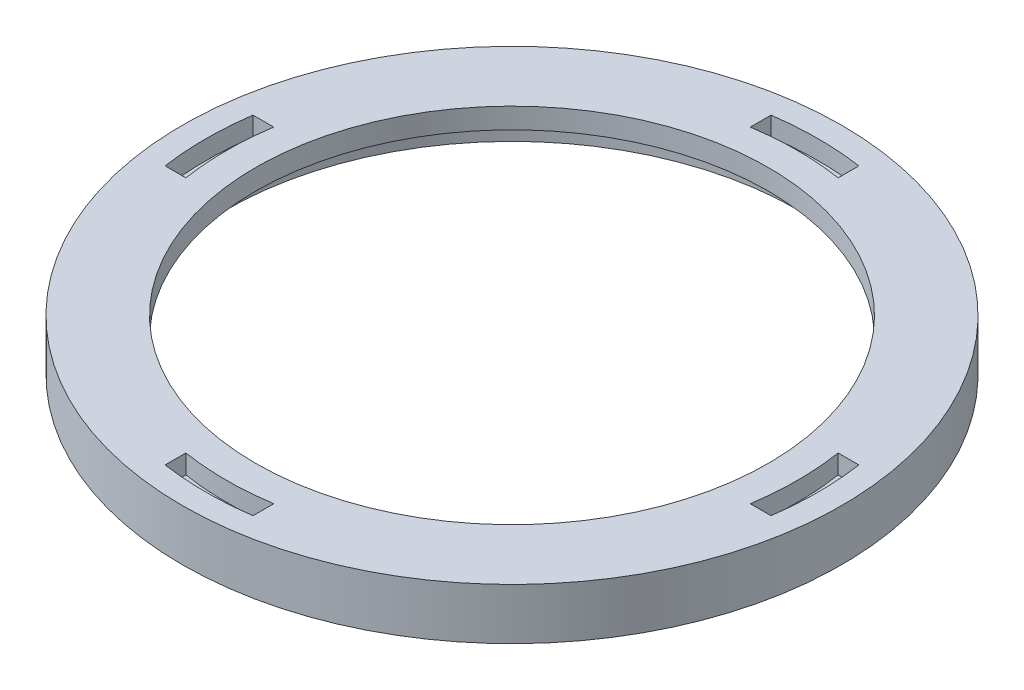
ISO-10303-21;
HEADER;
FILE_DESCRIPTION(('STEP AP214'),'2;1');
FILE_NAME('part.step','',(''),(''),'','','');
FILE_SCHEMA(('AUTOMOTIVE_DESIGN { 1 0 10303 214 1 1 1 1 }'));
ENDSEC;
DATA;
#1=APPLICATION_CONTEXT('core data for automotive mechanical design processes');
#2=APPLICATION_PROTOCOL_DEFINITION('international standard','automotive_design',2000,#1);
#3=PRODUCT_CONTEXT('',#1,'mechanical');
#4=PRODUCT('Part','Part','',(#3));
#5=PRODUCT_RELATED_PRODUCT_CATEGORY('part','',(#4));
#6=PRODUCT_DEFINITION_FORMATION('','',#4);
#7=PRODUCT_DEFINITION_CONTEXT('part definition',#1,'design');
#8=PRODUCT_DEFINITION('design','',#6,#7);
#9=PRODUCT_DEFINITION_SHAPE('','',#8);
#10=(LENGTH_UNIT() NAMED_UNIT(*) SI_UNIT(.MILLI.,.METRE.));
#11=(NAMED_UNIT(*) PLANE_ANGLE_UNIT() SI_UNIT($,.RADIAN.));
#12=(NAMED_UNIT(*) SI_UNIT($,.STERADIAN.) SOLID_ANGLE_UNIT());
#13=UNCERTAINTY_MEASURE_WITH_UNIT(LENGTH_MEASURE(1.E-05),#10,'distance_accuracy_value','');
#14=(GEOMETRIC_REPRESENTATION_CONTEXT(3) GLOBAL_UNCERTAINTY_ASSIGNED_CONTEXT((#13)) GLOBAL_UNIT_ASSIGNED_CONTEXT((#10,
#11,#12)) REPRESENTATION_CONTEXT('',''));
#15=CARTESIAN_POINT('',(0.,0.,0.));
#16=DIRECTION('',(0.,0.,1.));
#17=DIRECTION('',(1.,0.,0.));
#18=AXIS2_PLACEMENT_3D('',#15,#16,#17);
#19=CARTESIAN_POINT('',(0.,-4.445,0.));
#20=DIRECTION('',(0.,1.,0.));
#21=DIRECTION('',(0.,0.,1.));
#22=AXIS2_PLACEMENT_3D('',#19,#20,#21);
#23=CYLINDRICAL_SURFACE('',#22,22.225);
#24=CARTESIAN_POINT('',(0.,0.,0.));
#25=DIRECTION('',(0.,1.,0.));
#26=DIRECTION('',(0.,0.,1.));
#27=AXIS2_PLACEMENT_3D('',#24,#25,#26);
#28=CIRCLE('',#27,22.225);
#29=CARTESIAN_POINT('',(0.,0.,22.225));
#30=VERTEX_POINT('',#29);
#31=EDGE_CURVE('E268',#30,#30,#28,.T.);
#32=ORIENTED_EDGE('',*,*,#31,.T.);
#33=EDGE_LOOP('',(#32));
#34=FACE_BOUND('',#33,.T.);
#35=CARTESIAN_POINT('',(0.,-1.778,0.));
#36=DIRECTION('',(0.,-1.,0.));
#37=DIRECTION('',(0.,0.,-1.));
#38=AXIS2_PLACEMENT_3D('',#35,#36,#37);
#39=CIRCLE('',#38,22.225);
#40=CARTESIAN_POINT('',(0.,-1.778,-22.225));
#41=VERTEX_POINT('',#40);
#42=EDGE_CURVE('E32',#41,#41,#39,.F.);
#43=ORIENTED_EDGE('',*,*,#42,.F.);
#44=EDGE_LOOP('',(#43));
#45=FACE_BOUND('',#44,.T.);
#46=ADVANCED_FACE('F28',(#34,#45),#23,.F.);
#47=CARTESIAN_POINT('',(0.,0.,0.));
#48=DIRECTION('',(0.,1.,0.));
#49=DIRECTION('',(0.,0.,1.));
#50=AXIS2_PLACEMENT_3D('',#47,#48,#49);
#51=PLANE('',#50);
#52=CARTESIAN_POINT('',(0.,0.,0.));
#53=DIRECTION('',(0.,-1.,0.));
#54=DIRECTION('',(0.,0.,-1.));
#55=AXIS2_PLACEMENT_3D('',#52,#53,#54);
#56=CIRCLE('',#55,24.765);
#57=CARTESIAN_POINT('',(3.81000000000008,0.,24.4701680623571));
#58=VERTEX_POINT('',#57);
#59=CARTESIAN_POINT('',(-3.80999999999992,0.,24.4701680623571));
#60=VERTEX_POINT('',#59);
#61=EDGE_CURVE('E44',#58,#60,#56,.T.);
#62=ORIENTED_EDGE('',*,*,#61,.F.);
#63=DIRECTION('',(0.,0.,1.));
#64=VECTOR('',#63,1.);
#65=CARTESIAN_POINT('',(3.81000000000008,0.,24.4701680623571));
#66=LINE('',#65,#64);
#67=CARTESIAN_POINT('',(3.81000000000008,0.,26.2681318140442));
#68=VERTEX_POINT('',#67);
#69=EDGE_CURVE('E166',#58,#68,#66,.T.);
#70=ORIENTED_EDGE('',*,*,#69,.T.);
#71=CARTESIAN_POINT('',(0.,0.,0.));
#72=DIRECTION('',(0.,-1.,0.));
#73=DIRECTION('',(0.,0.,-1.));
#74=AXIS2_PLACEMENT_3D('',#71,#72,#73);
#75=CIRCLE('',#74,26.543);
#76=CARTESIAN_POINT('',(-3.80999999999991,0.,26.2681318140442));
#77=VERTEX_POINT('',#76);
#78=EDGE_CURVE('E148',#68,#77,#75,.T.);
#79=ORIENTED_EDGE('',*,*,#78,.T.);
#80=DIRECTION('',(0.,0.,1.));
#81=VECTOR('',#80,1.);
#82=CARTESIAN_POINT('',(-3.80999999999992,0.,24.4701680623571));
#83=LINE('',#82,#81);
#84=EDGE_CURVE('E159',#60,#77,#83,.T.);
#85=ORIENTED_EDGE('',*,*,#84,.F.);
#86=EDGE_LOOP('',(#62,#70,#79,#85));
#87=FACE_BOUND('',#86,.T.);
#88=CARTESIAN_POINT('',(0.,0.,0.));
#89=DIRECTION('',(0.,1.,0.));
#90=DIRECTION('',(0.,0.,1.));
#91=AXIS2_PLACEMENT_3D('',#88,#89,#90);
#92=CIRCLE('',#91,26.543);
#93=CARTESIAN_POINT('',(-26.2681318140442,0.,-3.81000000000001));
#94=VERTEX_POINT('',#93);
#95=CARTESIAN_POINT('',(-26.2681318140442,0.,3.80999999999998));
#96=VERTEX_POINT('',#95);
#97=EDGE_CURVE('E52',#94,#96,#92,.T.);
#98=ORIENTED_EDGE('',*,*,#97,.F.);
#99=DIRECTION('',(-1.,0.,0.));
#100=VECTOR('',#99,1.);
#101=CARTESIAN_POINT('',(-24.4701680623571,0.,-3.80999999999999));
#102=LINE('',#101,#100);
#103=CARTESIAN_POINT('',(-24.4701680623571,0.,-3.80999999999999));
#104=VERTEX_POINT('',#103);
#105=EDGE_CURVE('E190',#104,#94,#102,.T.);
#106=ORIENTED_EDGE('',*,*,#105,.F.);
#107=CARTESIAN_POINT('',(0.,0.,0.));
#108=DIRECTION('',(0.,1.,0.));
#109=DIRECTION('',(0.,0.,1.));
#110=AXIS2_PLACEMENT_3D('',#107,#108,#109);
#111=CIRCLE('',#110,24.765);
#112=CARTESIAN_POINT('',(-24.4701680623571,0.,3.81));
#113=VERTEX_POINT('',#112);
#114=EDGE_CURVE('E187',#104,#113,#111,.T.);
#115=ORIENTED_EDGE('',*,*,#114,.T.);
#116=DIRECTION('',(-1.,0.,0.));
#117=VECTOR('',#116,1.);
#118=CARTESIAN_POINT('',(-24.4701680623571,0.,3.81000000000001));
#119=LINE('',#118,#117);
#120=EDGE_CURVE('E184',#113,#96,#119,.T.);
#121=ORIENTED_EDGE('',*,*,#120,.T.);
#122=EDGE_LOOP('',(#98,#106,#115,#121));
#123=FACE_BOUND('',#122,.T.);
#124=CARTESIAN_POINT('',(0.,0.,0.));
#125=DIRECTION('',(0.,1.,0.));
#126=DIRECTION('',(0.,0.,1.));
#127=AXIS2_PLACEMENT_3D('',#124,#125,#126);
#128=CIRCLE('',#127,28.575);
#129=CARTESIAN_POINT('',(0.,0.,28.575));
#130=VERTEX_POINT('',#129);
#131=EDGE_CURVE('E37',#130,#130,#128,.T.);
#132=ORIENTED_EDGE('',*,*,#131,.T.);
#133=EDGE_LOOP('',(#132));
#134=FACE_BOUND('',#133,.T.);
#135=ORIENTED_EDGE('',*,*,#31,.F.);
#136=EDGE_LOOP('',(#135));
#137=FACE_BOUND('',#136,.T.);
#138=CARTESIAN_POINT('',(0.,0.,0.));
#139=DIRECTION('',(0.,-1.,0.));
#140=DIRECTION('',(0.,0.,-1.));
#141=AXIS2_PLACEMENT_3D('',#138,#139,#140);
#142=CIRCLE('',#141,24.765);
#143=CARTESIAN_POINT('',(-3.81000000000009,0.,-24.4701680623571));
#144=VERTEX_POINT('',#143);
#145=CARTESIAN_POINT('',(3.80999999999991,0.,-24.4701680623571));
#146=VERTEX_POINT('',#145);
#147=EDGE_CURVE('E244',#144,#146,#142,.T.);
#148=ORIENTED_EDGE('',*,*,#147,.F.);
#149=DIRECTION('',(0.,0.,-1.));
#150=VECTOR('',#149,1.);
#151=CARTESIAN_POINT('',(-3.81000000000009,0.,-24.4701680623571));
#152=LINE('',#151,#150);
#153=CARTESIAN_POINT('',(-3.81000000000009,0.,-26.2681318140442));
#154=VERTEX_POINT('',#153);
#155=EDGE_CURVE('E252',#144,#154,#152,.T.);
#156=ORIENTED_EDGE('',*,*,#155,.T.);
#157=CARTESIAN_POINT('',(0.,0.,0.));
#158=DIRECTION('',(0.,-1.,0.));
#159=DIRECTION('',(0.,0.,-1.));
#160=AXIS2_PLACEMENT_3D('',#157,#158,#159);
#161=CIRCLE('',#160,26.543);
#162=CARTESIAN_POINT('',(3.8099999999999,0.,-26.2681318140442));
#163=VERTEX_POINT('',#162);
#164=EDGE_CURVE('E249',#154,#163,#161,.T.);
#165=ORIENTED_EDGE('',*,*,#164,.T.);
#166=DIRECTION('',(0.,0.,-1.));
#167=VECTOR('',#166,1.);
#168=CARTESIAN_POINT('',(3.80999999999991,0.,-24.4701680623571));
#169=LINE('',#168,#167);
#170=EDGE_CURVE('E246',#146,#163,#169,.T.);
#171=ORIENTED_EDGE('',*,*,#170,.F.);
#172=EDGE_LOOP('',(#148,#156,#165,#171));
#173=FACE_BOUND('',#172,.T.);
#174=DIRECTION('',(1.,0.,0.));
#175=VECTOR('',#174,1.);
#176=CARTESIAN_POINT('',(24.4701680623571,0.,3.81));
#177=LINE('',#176,#175);
#178=CARTESIAN_POINT('',(24.4701680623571,0.,3.81));
#179=VERTEX_POINT('',#178);
#180=CARTESIAN_POINT('',(26.2681318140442,0.,3.81));
#181=VERTEX_POINT('',#180);
#182=EDGE_CURVE('E220',#179,#181,#177,.T.);
#183=ORIENTED_EDGE('',*,*,#182,.F.);
#184=CARTESIAN_POINT('',(0.,0.,0.));
#185=DIRECTION('',(0.,1.,0.));
#186=DIRECTION('',(0.,0.,1.));
#187=AXIS2_PLACEMENT_3D('',#184,#185,#186);
#188=CIRCLE('',#187,24.765);
#189=CARTESIAN_POINT('',(24.4701680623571,0.,-3.81));
#190=VERTEX_POINT('',#189);
#191=EDGE_CURVE('E206',#179,#190,#188,.T.);
#192=ORIENTED_EDGE('',*,*,#191,.T.);
#193=DIRECTION('',(1.,0.,0.));
#194=VECTOR('',#193,1.);
#195=CARTESIAN_POINT('',(24.4701680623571,0.,-3.81));
#196=LINE('',#195,#194);
#197=CARTESIAN_POINT('',(26.2681318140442,0.,-3.81));
#198=VERTEX_POINT('',#197);
#199=EDGE_CURVE('E214',#190,#198,#196,.T.);
#200=ORIENTED_EDGE('',*,*,#199,.T.);
#201=CARTESIAN_POINT('',(0.,0.,0.));
#202=DIRECTION('',(0.,1.,0.));
#203=DIRECTION('',(0.,0.,1.));
#204=AXIS2_PLACEMENT_3D('',#201,#202,#203);
#205=CIRCLE('',#204,26.543);
#206=EDGE_CURVE('E217',#181,#198,#205,.T.);
#207=ORIENTED_EDGE('',*,*,#206,.F.);
#208=EDGE_LOOP('',(#183,#192,#200,#207));
#209=FACE_BOUND('',#208,.T.);
#210=ADVANCED_FACE('F163',(#87,#123,#134,#137,#173,#209),#51,.T.);
#211=CARTESIAN_POINT('',(0.,-4.445,0.));
#212=DIRECTION('',(0.,1.,0.));
#213=DIRECTION('',(0.,0.,1.));
#214=AXIS2_PLACEMENT_3D('',#211,#212,#213);
#215=CYLINDRICAL_SURFACE('',#214,28.575);
#216=CARTESIAN_POINT('',(0.,-4.445,0.));
#217=DIRECTION('',(0.,1.,0.));
#218=DIRECTION('',(0.,0.,1.));
#219=AXIS2_PLACEMENT_3D('',#216,#217,#218);
#220=CIRCLE('',#219,28.575);
#221=CARTESIAN_POINT('',(0.,-4.445,28.575));
#222=VERTEX_POINT('',#221);
#223=EDGE_CURVE('E11',#222,#222,#220,.T.);
#224=ORIENTED_EDGE('',*,*,#223,.T.);
#225=EDGE_LOOP('',(#224));
#226=FACE_BOUND('',#225,.T.);
#227=ORIENTED_EDGE('',*,*,#131,.F.);
#228=EDGE_LOOP('',(#227));
#229=FACE_BOUND('',#228,.T.);
#230=ADVANCED_FACE('F30',(#226,#229),#215,.T.);
#231=CARTESIAN_POINT('',(0.,-4.445,0.));
#232=DIRECTION('',(0.,1.,0.));
#233=DIRECTION('',(0.,0.,1.));
#234=AXIS2_PLACEMENT_3D('',#231,#232,#233);
#235=PLANE('',#234);
#236=CARTESIAN_POINT('',(0.,-4.445,0.));
#237=DIRECTION('',(0.,-1.,0.));
#238=DIRECTION('',(0.,0.,-1.));
#239=AXIS2_PLACEMENT_3D('',#236,#237,#238);
#240=CIRCLE('',#239,24.765);
#241=CARTESIAN_POINT('',(0.,-4.445,-24.765));
#242=VERTEX_POINT('',#241);
#243=EDGE_CURVE('E387',#242,#242,#240,.T.);
#244=ORIENTED_EDGE('',*,*,#243,.F.);
#245=EDGE_LOOP('',(#244));
#246=FACE_BOUND('',#245,.T.);
#247=ORIENTED_EDGE('',*,*,#223,.F.);
#248=EDGE_LOOP('',(#247));
#249=FACE_BOUND('',#248,.T.);
#250=ADVANCED_FACE('F283',(#246,#249),#235,.F.);
#251=CARTESIAN_POINT('',(0.,-1.651,0.));
#252=DIRECTION('',(0.,1.,0.));
#253=DIRECTION('',(0.,0.,1.));
#254=AXIS2_PLACEMENT_3D('',#251,#252,#253);
#255=CYLINDRICAL_SURFACE('',#254,24.765);
#256=ORIENTED_EDGE('',*,*,#147,.T.);
#257=DIRECTION('',(0.,1.,0.));
#258=VECTOR('',#257,1.);
#259=CARTESIAN_POINT('',(3.80999999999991,-1.651,-24.4701680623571));
#260=LINE('',#259,#258);
#261=CARTESIAN_POINT('',(3.80999999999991,-1.651,-24.4701680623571));
#262=VERTEX_POINT('',#261);
#263=EDGE_CURVE('E265',#262,#146,#260,.T.);
#264=ORIENTED_EDGE('',*,*,#263,.F.);
#265=CARTESIAN_POINT('',(0.,-1.651,0.));
#266=DIRECTION('',(0.,-1.,0.));
#267=DIRECTION('',(0.,0.,-1.));
#268=AXIS2_PLACEMENT_3D('',#265,#266,#267);
#269=CIRCLE('',#268,24.765);
#270=CARTESIAN_POINT('',(-3.81000000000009,-1.651,-24.4701680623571));
#271=VERTEX_POINT('',#270);
#272=EDGE_CURVE('E255',#271,#262,#269,.T.);
#273=ORIENTED_EDGE('',*,*,#272,.F.);
#274=DIRECTION('',(0.,1.,0.));
#275=VECTOR('',#274,1.);
#276=CARTESIAN_POINT('',(-3.81000000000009,-1.651,-24.4701680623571));
#277=LINE('',#276,#275);
#278=EDGE_CURVE('E266',#271,#144,#277,.T.);
#279=ORIENTED_EDGE('',*,*,#278,.T.);
#280=EDGE_LOOP('',(#256,#264,#273,#279));
#281=FACE_BOUND('',#280,.T.);
#282=ADVANCED_FACE('F289',(#281),#255,.T.);
#283=CARTESIAN_POINT('',(-3.81000000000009,-1.651,-24.4701680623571));
#284=DIRECTION('',(1.,0.,0.));
#285=DIRECTION('',(0.,0.,-1.));
#286=AXIS2_PLACEMENT_3D('',#283,#284,#285);
#287=PLANE('',#286);
#288=ORIENTED_EDGE('',*,*,#155,.F.);
#289=ORIENTED_EDGE('',*,*,#278,.F.);
#290=DIRECTION('',(0.,0.,-1.));
#291=VECTOR('',#290,1.);
#292=CARTESIAN_POINT('',(-3.81000000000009,-1.651,-24.4701680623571));
#293=LINE('',#292,#291);
#294=CARTESIAN_POINT('',(-3.81000000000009,-1.651,-26.2681318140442));
#295=VERTEX_POINT('',#294);
#296=EDGE_CURVE('E263',#271,#295,#293,.T.);
#297=ORIENTED_EDGE('',*,*,#296,.T.);
#298=DIRECTION('',(0.,1.,0.));
#299=VECTOR('',#298,1.);
#300=CARTESIAN_POINT('',(-3.81000000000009,-1.651,-26.2681318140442));
#301=LINE('',#300,#299);
#302=EDGE_CURVE('E269',#295,#154,#301,.T.);
#303=ORIENTED_EDGE('',*,*,#302,.T.);
#304=EDGE_LOOP('',(#288,#289,#297,#303));
#305=FACE_BOUND('',#304,.T.);
#306=ADVANCED_FACE('F302',(#305),#287,.T.);
#307=CARTESIAN_POINT('',(0.,-1.651,0.));
#308=DIRECTION('',(0.,1.,0.));
#309=DIRECTION('',(0.,0.,1.));
#310=AXIS2_PLACEMENT_3D('',#307,#308,#309);
#311=CYLINDRICAL_SURFACE('',#310,26.543);
#312=ORIENTED_EDGE('',*,*,#164,.F.);
#313=ORIENTED_EDGE('',*,*,#302,.F.);
#314=CARTESIAN_POINT('',(0.,-1.651,0.));
#315=DIRECTION('',(0.,-1.,0.));
#316=DIRECTION('',(0.,0.,-1.));
#317=AXIS2_PLACEMENT_3D('',#314,#315,#316);
#318=CIRCLE('',#317,26.543);
#319=CARTESIAN_POINT('',(3.8099999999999,-1.651,-26.2681318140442));
#320=VERTEX_POINT('',#319);
#321=EDGE_CURVE('E261',#295,#320,#318,.T.);
#322=ORIENTED_EDGE('',*,*,#321,.T.);
#323=DIRECTION('',(0.,1.,0.));
#324=VECTOR('',#323,1.);
#325=CARTESIAN_POINT('',(3.8099999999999,-1.651,-26.2681318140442));
#326=LINE('',#325,#324);
#327=EDGE_CURVE('E271',#320,#163,#326,.T.);
#328=ORIENTED_EDGE('',*,*,#327,.T.);
#329=EDGE_LOOP('',(#312,#313,#322,#328));
#330=FACE_BOUND('',#329,.T.);
#331=ADVANCED_FACE('F308',(#330),#311,.F.);
#332=CARTESIAN_POINT('',(3.80999999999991,-1.651,-24.4701680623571));
#333=DIRECTION('',(1.,0.,0.));
#334=DIRECTION('',(0.,0.,-1.));
#335=AXIS2_PLACEMENT_3D('',#332,#333,#334);
#336=PLANE('',#335);
#337=ORIENTED_EDGE('',*,*,#170,.T.);
#338=ORIENTED_EDGE('',*,*,#327,.F.);
#339=DIRECTION('',(0.,0.,-1.));
#340=VECTOR('',#339,1.);
#341=CARTESIAN_POINT('',(3.80999999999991,-1.651,-24.4701680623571));
#342=LINE('',#341,#340);
#343=EDGE_CURVE('E258',#262,#320,#342,.T.);
#344=ORIENTED_EDGE('',*,*,#343,.F.);
#345=ORIENTED_EDGE('',*,*,#263,.T.);
#346=EDGE_LOOP('',(#337,#338,#344,#345));
#347=FACE_BOUND('',#346,.T.);
#348=ADVANCED_FACE('F304',(#347),#336,.F.);
#349=CARTESIAN_POINT('',(0.,-1.651,0.));
#350=DIRECTION('',(0.,-1.,0.));
#351=DIRECTION('',(0.,0.,-1.));
#352=AXIS2_PLACEMENT_3D('',#349,#350,#351);
#353=PLANE('',#352);
#354=ORIENTED_EDGE('',*,*,#272,.T.);
#355=ORIENTED_EDGE('',*,*,#343,.T.);
#356=ORIENTED_EDGE('',*,*,#321,.F.);
#357=ORIENTED_EDGE('',*,*,#296,.F.);
#358=EDGE_LOOP('',(#354,#355,#356,#357));
#359=FACE_BOUND('',#358,.T.);
#360=ADVANCED_FACE('F307',(#359),#353,.F.);
#361=CARTESIAN_POINT('',(0.,-1.651,0.));
#362=DIRECTION('',(0.,1.,0.));
#363=DIRECTION('',(0.,0.,1.));
#364=AXIS2_PLACEMENT_3D('',#361,#362,#363);
#365=CYLINDRICAL_SURFACE('',#364,24.765);
#366=ORIENTED_EDGE('',*,*,#191,.F.);
#367=DIRECTION('',(0.,1.,0.));
#368=VECTOR('',#367,1.);
#369=CARTESIAN_POINT('',(24.4701680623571,-1.651,3.81));
#370=LINE('',#369,#368);
#371=CARTESIAN_POINT('',(24.4701680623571,-1.651,3.81));
#372=VERTEX_POINT('',#371);
#373=EDGE_CURVE('E234',#372,#179,#370,.T.);
#374=ORIENTED_EDGE('',*,*,#373,.F.);
#375=CARTESIAN_POINT('',(0.,-1.651,0.));
#376=DIRECTION('',(0.,1.,0.));
#377=DIRECTION('',(0.,0.,1.));
#378=AXIS2_PLACEMENT_3D('',#375,#376,#377);
#379=CIRCLE('',#378,24.765);
#380=CARTESIAN_POINT('',(24.4701680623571,-1.651,-3.81));
#381=VERTEX_POINT('',#380);
#382=EDGE_CURVE('E223',#372,#381,#379,.T.);
#383=ORIENTED_EDGE('',*,*,#382,.T.);
#384=DIRECTION('',(0.,1.,0.));
#385=VECTOR('',#384,1.);
#386=CARTESIAN_POINT('',(24.4701680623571,-1.651,-3.81));
#387=LINE('',#386,#385);
#388=EDGE_CURVE('E241',#381,#190,#387,.T.);
#389=ORIENTED_EDGE('',*,*,#388,.T.);
#390=EDGE_LOOP('',(#366,#374,#383,#389));
#391=FACE_BOUND('',#390,.T.);
#392=ADVANCED_FACE('F318',(#391),#365,.T.);
#393=CARTESIAN_POINT('',(24.4701680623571,-1.651,-3.81));
#394=DIRECTION('',(0.,0.,1.));
#395=DIRECTION('',(1.,0.,0.));
#396=AXIS2_PLACEMENT_3D('',#393,#394,#395);
#397=PLANE('',#396);
#398=ORIENTED_EDGE('',*,*,#199,.F.);
#399=ORIENTED_EDGE('',*,*,#388,.F.);
#400=DIRECTION('',(1.,0.,0.));
#401=VECTOR('',#400,1.);
#402=CARTESIAN_POINT('',(24.4701680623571,-1.651,-3.81));
#403=LINE('',#402,#401);
#404=CARTESIAN_POINT('',(26.2681318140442,-1.651,-3.81));
#405=VERTEX_POINT('',#404);
#406=EDGE_CURVE('E226',#381,#405,#403,.T.);
#407=ORIENTED_EDGE('',*,*,#406,.T.);
#408=DIRECTION('',(0.,1.,0.));
#409=VECTOR('',#408,1.);
#410=CARTESIAN_POINT('',(26.2681318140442,-1.651,-3.81));
#411=LINE('',#410,#409);
#412=EDGE_CURVE('E239',#405,#198,#411,.T.);
#413=ORIENTED_EDGE('',*,*,#412,.T.);
#414=EDGE_LOOP('',(#398,#399,#407,#413));
#415=FACE_BOUND('',#414,.T.);
#416=ADVANCED_FACE('F322',(#415),#397,.T.);
#417=CARTESIAN_POINT('',(0.,-1.651,0.));
#418=DIRECTION('',(0.,1.,0.));
#419=DIRECTION('',(0.,0.,1.));
#420=AXIS2_PLACEMENT_3D('',#417,#418,#419);
#421=CYLINDRICAL_SURFACE('',#420,26.543);
#422=ORIENTED_EDGE('',*,*,#206,.T.);
#423=ORIENTED_EDGE('',*,*,#412,.F.);
#424=CARTESIAN_POINT('',(0.,-1.651,0.));
#425=DIRECTION('',(0.,1.,0.));
#426=DIRECTION('',(0.,0.,1.));
#427=AXIS2_PLACEMENT_3D('',#424,#425,#426);
#428=CIRCLE('',#427,26.543);
#429=CARTESIAN_POINT('',(26.2681318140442,-1.651,3.81));
#430=VERTEX_POINT('',#429);
#431=EDGE_CURVE('E228',#430,#405,#428,.T.);
#432=ORIENTED_EDGE('',*,*,#431,.F.);
#433=DIRECTION('',(0.,1.,0.));
#434=VECTOR('',#433,1.);
#435=CARTESIAN_POINT('',(26.2681318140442,-1.651,3.81));
#436=LINE('',#435,#434);
#437=EDGE_CURVE('E237',#430,#181,#436,.T.);
#438=ORIENTED_EDGE('',*,*,#437,.T.);
#439=EDGE_LOOP('',(#422,#423,#432,#438));
#440=FACE_BOUND('',#439,.T.);
#441=ADVANCED_FACE('F326',(#440),#421,.F.);
#442=CARTESIAN_POINT('',(24.4701680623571,-1.651,3.81));
#443=DIRECTION('',(0.,0.,1.));
#444=DIRECTION('',(1.,0.,0.));
#445=AXIS2_PLACEMENT_3D('',#442,#443,#444);
#446=PLANE('',#445);
#447=ORIENTED_EDGE('',*,*,#182,.T.);
#448=ORIENTED_EDGE('',*,*,#437,.F.);
#449=DIRECTION('',(1.,0.,0.));
#450=VECTOR('',#449,1.);
#451=CARTESIAN_POINT('',(24.4701680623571,-1.651,3.81));
#452=LINE('',#451,#450);
#453=EDGE_CURVE('E231',#372,#430,#452,.T.);
#454=ORIENTED_EDGE('',*,*,#453,.F.);
#455=ORIENTED_EDGE('',*,*,#373,.T.);
#456=EDGE_LOOP('',(#447,#448,#454,#455));
#457=FACE_BOUND('',#456,.T.);
#458=ADVANCED_FACE('F330',(#457),#446,.F.);
#459=CARTESIAN_POINT('',(0.,-1.651,0.));
#460=DIRECTION('',(0.,1.,0.));
#461=DIRECTION('',(0.,0.,1.));
#462=AXIS2_PLACEMENT_3D('',#459,#460,#461);
#463=PLANE('',#462);
#464=ORIENTED_EDGE('',*,*,#382,.F.);
#465=ORIENTED_EDGE('',*,*,#453,.T.);
#466=ORIENTED_EDGE('',*,*,#431,.T.);
#467=ORIENTED_EDGE('',*,*,#406,.F.);
#468=EDGE_LOOP('',(#464,#465,#466,#467));
#469=FACE_BOUND('',#468,.T.);
#470=ADVANCED_FACE('F334',(#469),#463,.T.);
#471=CARTESIAN_POINT('',(0.,-1.651,0.));
#472=DIRECTION('',(0.,1.,0.));
#473=DIRECTION('',(0.,0.,1.));
#474=AXIS2_PLACEMENT_3D('',#471,#472,#473);
#475=CYLINDRICAL_SURFACE('',#474,26.543);
#476=ORIENTED_EDGE('',*,*,#97,.T.);
#477=DIRECTION('',(0.,1.,0.));
#478=VECTOR('',#477,1.);
#479=CARTESIAN_POINT('',(-26.2681318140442,-1.651,3.80999999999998));
#480=LINE('',#479,#478);
#481=CARTESIAN_POINT('',(-26.2681318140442,-1.651,3.80999999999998));
#482=VERTEX_POINT('',#481);
#483=EDGE_CURVE('E203',#482,#96,#480,.T.);
#484=ORIENTED_EDGE('',*,*,#483,.F.);
#485=CARTESIAN_POINT('',(0.,-1.651,0.));
#486=DIRECTION('',(0.,1.,0.));
#487=DIRECTION('',(0.,0.,1.));
#488=AXIS2_PLACEMENT_3D('',#485,#486,#487);
#489=CIRCLE('',#488,26.543);
#490=CARTESIAN_POINT('',(-26.2681318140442,-1.651,-3.81000000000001));
#491=VERTEX_POINT('',#490);
#492=EDGE_CURVE('E193',#491,#482,#489,.T.);
#493=ORIENTED_EDGE('',*,*,#492,.F.);
#494=DIRECTION('',(0.,1.,0.));
#495=VECTOR('',#494,1.);
#496=CARTESIAN_POINT('',(-26.2681318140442,-1.651,-3.81000000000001));
#497=LINE('',#496,#495);
#498=EDGE_CURVE('E204',#491,#94,#497,.T.);
#499=ORIENTED_EDGE('',*,*,#498,.T.);
#500=EDGE_LOOP('',(#476,#484,#493,#499));
#501=FACE_BOUND('',#500,.T.);
#502=ADVANCED_FACE('F338',(#501),#475,.F.);
#503=CARTESIAN_POINT('',(-24.4701680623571,-1.651,-3.80999999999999));
#504=DIRECTION('',(0.,0.,-1.));
#505=DIRECTION('',(-1.,0.,0.));
#506=AXIS2_PLACEMENT_3D('',#503,#504,#505);
#507=PLANE('',#506);
#508=ORIENTED_EDGE('',*,*,#105,.T.);
#509=ORIENTED_EDGE('',*,*,#498,.F.);
#510=DIRECTION('',(-1.,0.,0.));
#511=VECTOR('',#510,1.);
#512=CARTESIAN_POINT('',(-24.4701680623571,-1.651,-3.80999999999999));
#513=LINE('',#512,#511);
#514=CARTESIAN_POINT('',(-24.4701680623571,-1.651,-3.80999999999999));
#515=VERTEX_POINT('',#514);
#516=EDGE_CURVE('E200',#515,#491,#513,.T.);
#517=ORIENTED_EDGE('',*,*,#516,.F.);
#518=DIRECTION('',(0.,1.,0.));
#519=VECTOR('',#518,1.);
#520=CARTESIAN_POINT('',(-24.4701680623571,-1.651,-3.80999999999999));
#521=LINE('',#520,#519);
#522=EDGE_CURVE('E207',#515,#104,#521,.T.);
#523=ORIENTED_EDGE('',*,*,#522,.T.);
#524=EDGE_LOOP('',(#508,#509,#517,#523));
#525=FACE_BOUND('',#524,.T.);
#526=ADVANCED_FACE('F342',(#525),#507,.F.);
#527=CARTESIAN_POINT('',(0.,-1.651,0.));
#528=DIRECTION('',(0.,1.,0.));
#529=DIRECTION('',(0.,0.,1.));
#530=AXIS2_PLACEMENT_3D('',#527,#528,#529);
#531=CYLINDRICAL_SURFACE('',#530,24.765);
#532=ORIENTED_EDGE('',*,*,#114,.F.);
#533=ORIENTED_EDGE('',*,*,#522,.F.);
#534=CARTESIAN_POINT('',(0.,-1.651,0.));
#535=DIRECTION('',(0.,1.,0.));
#536=DIRECTION('',(0.,0.,1.));
#537=AXIS2_PLACEMENT_3D('',#534,#535,#536);
#538=CIRCLE('',#537,24.765);
#539=CARTESIAN_POINT('',(-24.4701680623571,-1.651,3.81));
#540=VERTEX_POINT('',#539);
#541=EDGE_CURVE('E198',#515,#540,#538,.T.);
#542=ORIENTED_EDGE('',*,*,#541,.T.);
#543=DIRECTION('',(0.,1.,0.));
#544=VECTOR('',#543,1.);
#545=CARTESIAN_POINT('',(-24.4701680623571,-1.651,3.81));
#546=LINE('',#545,#544);
#547=EDGE_CURVE('E209',#540,#113,#546,.T.);
#548=ORIENTED_EDGE('',*,*,#547,.T.);
#549=EDGE_LOOP('',(#532,#533,#542,#548));
#550=FACE_BOUND('',#549,.T.);
#551=ADVANCED_FACE('F347',(#550),#531,.T.);
#552=CARTESIAN_POINT('',(-24.4701680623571,-1.651,3.81000000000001));
#553=DIRECTION('',(0.,0.,-1.));
#554=DIRECTION('',(-1.,0.,0.));
#555=AXIS2_PLACEMENT_3D('',#552,#553,#554);
#556=PLANE('',#555);
#557=ORIENTED_EDGE('',*,*,#120,.F.);
#558=ORIENTED_EDGE('',*,*,#547,.F.);
#559=DIRECTION('',(-1.,0.,0.));
#560=VECTOR('',#559,1.);
#561=CARTESIAN_POINT('',(-24.4701680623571,-1.651,3.81000000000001));
#562=LINE('',#561,#560);
#563=EDGE_CURVE('E196',#540,#482,#562,.T.);
#564=ORIENTED_EDGE('',*,*,#563,.T.);
#565=ORIENTED_EDGE('',*,*,#483,.T.);
#566=EDGE_LOOP('',(#557,#558,#564,#565));
#567=FACE_BOUND('',#566,.T.);
#568=ADVANCED_FACE('F343',(#567),#556,.T.);
#569=CARTESIAN_POINT('',(0.,-1.651,0.));
#570=DIRECTION('',(0.,1.,0.));
#571=DIRECTION('',(0.,0.,1.));
#572=AXIS2_PLACEMENT_3D('',#569,#570,#571);
#573=PLANE('',#572);
#574=ORIENTED_EDGE('',*,*,#492,.T.);
#575=ORIENTED_EDGE('',*,*,#563,.F.);
#576=ORIENTED_EDGE('',*,*,#541,.F.);
#577=ORIENTED_EDGE('',*,*,#516,.T.);
#578=EDGE_LOOP('',(#574,#575,#576,#577));
#579=FACE_BOUND('',#578,.T.);
#580=ADVANCED_FACE('F346',(#579),#573,.T.);
#581=CARTESIAN_POINT('',(0.,-1.651,0.));
#582=DIRECTION('',(0.,1.,0.));
#583=DIRECTION('',(0.,0.,1.));
#584=AXIS2_PLACEMENT_3D('',#581,#582,#583);
#585=CYLINDRICAL_SURFACE('',#584,24.765);
#586=ORIENTED_EDGE('',*,*,#61,.T.);
#587=DIRECTION('',(0.,1.,0.));
#588=VECTOR('',#587,1.);
#589=CARTESIAN_POINT('',(-3.80999999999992,-1.651,24.4701680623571));
#590=LINE('',#589,#588);
#591=CARTESIAN_POINT('',(-3.80999999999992,-1.651,24.4701680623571));
#592=VERTEX_POINT('',#591);
#593=EDGE_CURVE('E156',#592,#60,#590,.T.);
#594=ORIENTED_EDGE('',*,*,#593,.F.);
#595=CARTESIAN_POINT('',(0.,-1.651,0.));
#596=DIRECTION('',(0.,-1.,0.));
#597=DIRECTION('',(0.,0.,-1.));
#598=AXIS2_PLACEMENT_3D('',#595,#596,#597);
#599=CIRCLE('',#598,24.765);
#600=CARTESIAN_POINT('',(3.81000000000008,-1.651,24.4701680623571));
#601=VERTEX_POINT('',#600);
#602=EDGE_CURVE('E168',#601,#592,#599,.T.);
#603=ORIENTED_EDGE('',*,*,#602,.F.);
#604=DIRECTION('',(0.,1.,0.));
#605=VECTOR('',#604,1.);
#606=CARTESIAN_POINT('',(3.81000000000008,-1.651,24.4701680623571));
#607=LINE('',#606,#605);
#608=EDGE_CURVE('E179',#601,#58,#607,.T.);
#609=ORIENTED_EDGE('',*,*,#608,.T.);
#610=EDGE_LOOP('',(#586,#594,#603,#609));
#611=FACE_BOUND('',#610,.T.);
#612=ADVANCED_FACE('F357',(#611),#585,.T.);
#613=CARTESIAN_POINT('',(3.81000000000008,-1.651,24.4701680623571));
#614=DIRECTION('',(-1.,0.,0.));
#615=DIRECTION('',(0.,0.,1.));
#616=AXIS2_PLACEMENT_3D('',#613,#614,#615);
#617=PLANE('',#616);
#618=ORIENTED_EDGE('',*,*,#69,.F.);
#619=ORIENTED_EDGE('',*,*,#608,.F.);
#620=DIRECTION('',(0.,0.,1.));
#621=VECTOR('',#620,1.);
#622=CARTESIAN_POINT('',(3.81000000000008,-1.651,24.4701680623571));
#623=LINE('',#622,#621);
#624=CARTESIAN_POINT('',(3.81000000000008,-1.651,26.2681318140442));
#625=VERTEX_POINT('',#624);
#626=EDGE_CURVE('E177',#601,#625,#623,.T.);
#627=ORIENTED_EDGE('',*,*,#626,.T.);
#628=DIRECTION('',(0.,1.,0.));
#629=VECTOR('',#628,1.);
#630=CARTESIAN_POINT('',(3.81000000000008,-1.651,26.2681318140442));
#631=LINE('',#630,#629);
#632=EDGE_CURVE('E155',#625,#68,#631,.T.);
#633=ORIENTED_EDGE('',*,*,#632,.T.);
#634=EDGE_LOOP('',(#618,#619,#627,#633));
#635=FACE_BOUND('',#634,.T.);
#636=ADVANCED_FACE('F361',(#635),#617,.T.);
#637=CARTESIAN_POINT('',(0.,-1.651,0.));
#638=DIRECTION('',(0.,1.,0.));
#639=DIRECTION('',(0.,0.,1.));
#640=AXIS2_PLACEMENT_3D('',#637,#638,#639);
#641=CYLINDRICAL_SURFACE('',#640,26.543);
#642=ORIENTED_EDGE('',*,*,#78,.F.);
#643=ORIENTED_EDGE('',*,*,#632,.F.);
#644=CARTESIAN_POINT('',(0.,-1.651,0.));
#645=DIRECTION('',(0.,-1.,0.));
#646=DIRECTION('',(0.,0.,-1.));
#647=AXIS2_PLACEMENT_3D('',#644,#645,#646);
#648=CIRCLE('',#647,26.543);
#649=CARTESIAN_POINT('',(-3.80999999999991,-1.651,26.2681318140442));
#650=VERTEX_POINT('',#649);
#651=EDGE_CURVE('E151',#625,#650,#648,.T.);
#652=ORIENTED_EDGE('',*,*,#651,.T.);
#653=DIRECTION('',(0.,1.,0.));
#654=VECTOR('',#653,1.);
#655=CARTESIAN_POINT('',(-3.80999999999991,-1.651,26.2681318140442));
#656=LINE('',#655,#654);
#657=EDGE_CURVE('E143',#650,#77,#656,.T.);
#658=ORIENTED_EDGE('',*,*,#657,.T.);
#659=EDGE_LOOP('',(#642,#643,#652,#658));
#660=FACE_BOUND('',#659,.T.);
#661=ADVANCED_FACE('F145',(#660),#641,.F.);
#662=CARTESIAN_POINT('',(-3.80999999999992,-1.651,24.4701680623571));
#663=DIRECTION('',(-1.,0.,0.));
#664=DIRECTION('',(0.,0.,1.));
#665=AXIS2_PLACEMENT_3D('',#662,#663,#664);
#666=PLANE('',#665);
#667=ORIENTED_EDGE('',*,*,#84,.T.);
#668=ORIENTED_EDGE('',*,*,#657,.F.);
#669=DIRECTION('',(0.,0.,1.));
#670=VECTOR('',#669,1.);
#671=CARTESIAN_POINT('',(-3.80999999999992,-1.651,24.4701680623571));
#672=LINE('',#671,#670);
#673=EDGE_CURVE('E174',#592,#650,#672,.T.);
#674=ORIENTED_EDGE('',*,*,#673,.F.);
#675=ORIENTED_EDGE('',*,*,#593,.T.);
#676=EDGE_LOOP('',(#667,#668,#674,#675));
#677=FACE_BOUND('',#676,.T.);
#678=ADVANCED_FACE('F160',(#677),#666,.F.);
#679=CARTESIAN_POINT('',(0.,-1.651,0.));
#680=DIRECTION('',(0.,-1.,0.));
#681=DIRECTION('',(0.,0.,-1.));
#682=AXIS2_PLACEMENT_3D('',#679,#680,#681);
#683=PLANE('',#682);
#684=ORIENTED_EDGE('',*,*,#602,.T.);
#685=ORIENTED_EDGE('',*,*,#673,.T.);
#686=ORIENTED_EDGE('',*,*,#651,.F.);
#687=ORIENTED_EDGE('',*,*,#626,.F.);
#688=EDGE_LOOP('',(#684,#685,#686,#687));
#689=FACE_BOUND('',#688,.T.);
#690=ADVANCED_FACE('F364',(#689),#683,.F.);
#691=CARTESIAN_POINT('',(0.,-1.778,0.));
#692=DIRECTION('',(0.,-1.,0.));
#693=DIRECTION('',(0.,0.,-1.));
#694=AXIS2_PLACEMENT_3D('',#691,#692,#693);
#695=PLANE('',#694);
#696=CARTESIAN_POINT('',(0.,-1.778,0.));
#697=DIRECTION('',(0.,-1.,0.));
#698=DIRECTION('',(0.,0.,-1.));
#699=AXIS2_PLACEMENT_3D('',#696,#697,#698);
#700=CIRCLE('',#699,24.765);
#701=CARTESIAN_POINT('',(0.,-1.778,-24.765));
#702=VERTEX_POINT('',#701);
#703=EDGE_CURVE('E384',#702,#702,#700,.T.);
#704=ORIENTED_EDGE('',*,*,#703,.T.);
#705=EDGE_LOOP('',(#704));
#706=FACE_BOUND('',#705,.T.);
#707=ORIENTED_EDGE('',*,*,#42,.T.);
#708=EDGE_LOOP('',(#707));
#709=FACE_BOUND('',#708,.T.);
#710=ADVANCED_FACE('F371',(#706,#709),#695,.T.);
#711=CARTESIAN_POINT('',(0.,-1.778,0.));
#712=DIRECTION('',(0.,-1.,0.));
#713=DIRECTION('',(0.,0.,-1.));
#714=AXIS2_PLACEMENT_3D('',#711,#712,#713);
#715=CYLINDRICAL_SURFACE('',#714,24.765);
#716=ORIENTED_EDGE('',*,*,#703,.F.);
#717=EDGE_LOOP('',(#716));
#718=FACE_BOUND('',#717,.T.);
#719=ORIENTED_EDGE('',*,*,#243,.T.);
#720=EDGE_LOOP('',(#719));
#721=FACE_BOUND('',#720,.T.);
#722=ADVANCED_FACE('F373',(#718,#721),#715,.F.);
#723=CLOSED_SHELL('',(#46,#210,#230,#250,#282,#306,#331,#348,#360,#392,#416,#441,#458,#470,#502,
#526,#551,#568,#580,#612,#636,#661,#678,#690,#710,#722));
#724=MANIFOLD_SOLID_BREP('B2',#723);
#725=ADVANCED_BREP_SHAPE_REPRESENTATION('',(#18,#724),#14);
#726=SHAPE_DEFINITION_REPRESENTATION(#9,#725);
ENDSEC;
END-ISO-10303-21;
